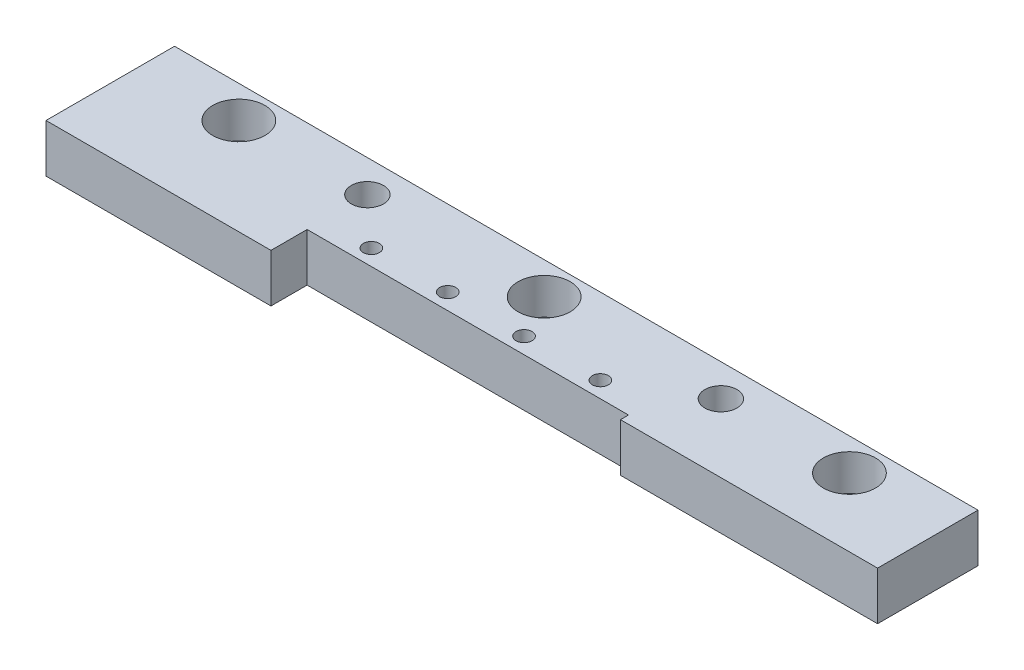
from build123d import *

# Parameters (mm, degrees)
SKETCH_1_W           = 100
SKETCH_1_H           = 6
EXTRUDE_1_DEPTH      = 16
SKETCH_2_OUTSIDE_W   = 122.29
SKETCH_2_OUTSIDE_H   = 38.29
SKETCH_2_OUTSIDE_R   = 1
SKETCH_2_OUTSIDE_R_2 = 1.75
SKETCH_2_OUTSIDE_R_3 = 2
CUT_EXTRUDE_1_DEPTH  = 16
SKETCH_3_R           = 3.25
CUT_EXTRUDE_2_DEPTH  = 4.5


with BuildPart() as part:
    # Sketch 1 → Extrude 1 (new body)
    with BuildSketch(Plane.XY):
        with Locations((50, 3)):
            Rectangle(SKETCH_1_W, SKETCH_1_H)
    extrude(amount=EXTRUDE_1_DEPTH)

    # Sketch 2 outside → Cut-Extrude 1 (cut)
    # profile 1 of 10: a face of its own
    with BuildSketch(Plane(origin=(0, 6, 0), x_dir=(1, 0, 0), z_dir=(0, 1, 0))):
        with Locations((50, -8)):
            Rectangle(SKETCH_2_OUTSIDE_W, SKETCH_2_OUTSIDE_H)
        Polygon((0, 0), (100, 0), (100, -12.5), (68, -12.5), (68, -11.5), (28, -11.5), (28, -16), (0, -16), align=None, mode=Mode.SUBTRACT)
    # profile 2 of 10: a face of its own
    with BuildSketch(Plane(origin=(0, 6, 0), x_dir=(1, 0, 0), z_dir=(0, 1, 0))):
        with Locations(Location((62.5, -9.5, 0), (0, 0, 270))):
            Circle(SKETCH_2_OUTSIDE_R)
    # profile 3 of 10: a face of its own
    with BuildSketch(Plane(origin=(0, 6, 0), x_dir=(1, 0, 0), z_dir=(0, 1, 0))):
        with Locations(Location((53, -9.5, 0), (0, 0, 270))):
            Circle(SKETCH_2_OUTSIDE_R)
    # profile 4 of 10: a face of its own
    with BuildSketch(Plane(origin=(0, 6, 0), x_dir=(1, 0, 0), z_dir=(0, 1, 0))):
        with Locations(Location((43.5, -9.5, 0), (0, 0, 270))):
            Circle(SKETCH_2_OUTSIDE_R)
    # profile 5 of 10: a face of its own
    with BuildSketch(Plane(origin=(0, 6, 0), x_dir=(1, 0, 0), z_dir=(0, 1, 0))):
        with Locations(Location((34, -9.5, 0), (0, 0, 270))):
            Circle(SKETCH_2_OUTSIDE_R)
    # profile 6 of 10: a face of its own
    with BuildSketch(Plane(origin=(0, 6, 0), x_dir=(1, 0, 0), z_dir=(0, 1, 0))):
        with Locations(Location((12, -4, 0), (0, 0, 270))):
            Circle(SKETCH_2_OUTSIDE_R_2)
    # profile 7 of 10: a face of its own
    with BuildSketch(Plane(origin=(0, 6, 0), x_dir=(1, 0, 0), z_dir=(0, 1, 0))):
        with Locations(Location((88, -4, 0), (0, 0, 270))):
            Circle(SKETCH_2_OUTSIDE_R_2)
    # profile 8 of 10: a face of its own
    with BuildSketch(Plane(origin=(0, 6, 0), x_dir=(1, 0, 0), z_dir=(0, 1, 0))):
        with Locations(Location((50, -4, 0), (0, 0, 270))):
            Circle(SKETCH_2_OUTSIDE_R_2)
    # profile 9 of 10: a face of its own
    with BuildSketch(Plane(origin=(0, 6, 0), x_dir=(1, 0, 0), z_dir=(0, 1, 0))):
        with Locations(Location((28, -4, 0), (0, 0, 270))):
            Circle(SKETCH_2_OUTSIDE_R_3)
    # profile 10 of 10: a face of its own
    with BuildSketch(Plane(origin=(0, 6, 0), x_dir=(1, 0, 0), z_dir=(0, 1, 0))):
        with Locations(Location((72, -4, 0), (0, 0, 270))):
            Circle(SKETCH_2_OUTSIDE_R_3)
    extrude(amount=-CUT_EXTRUDE_1_DEPTH, mode=Mode.SUBTRACT)

    # Sketch 3 → Cut-Extrude 2 (cut)
    with BuildSketch(Plane(origin=(0, 6, 0), x_dir=(1, 0, 0), z_dir=(0, 1, 0))):
        with Locations(Location((12, -4, 0), (0, 0, 270))):
            Circle(SKETCH_3_R)
        with Locations(Location((88, -4, 0), (0, 0, 270))):
            Circle(SKETCH_3_R)
        with Locations(Location((50, -4, 0), (0, 0, 270))):
            Circle(SKETCH_3_R)
    extrude(amount=-CUT_EXTRUDE_2_DEPTH, mode=Mode.SUBTRACT)


solid = part.part
